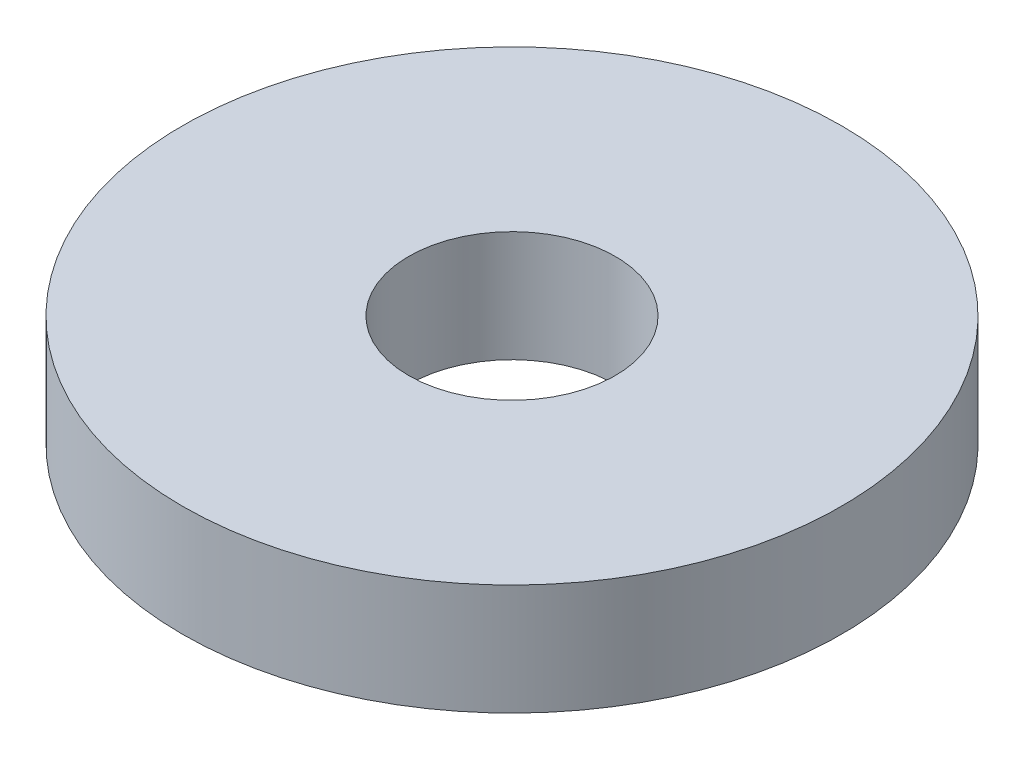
from build123d import *

# Parameters (mm, degrees)
SKETCH1_R      = 2.6416
SKETCH1_R_2    = 0.82804
EXTRUDE1_DEPTH = 0.889


with BuildPart() as part:
    # Sketch1 → Extrude1 (new body)
    with BuildSketch(Plane(origin=(0, 0, 0), x_dir=(1, 0, 0), z_dir=(0, 1, 0))):
        with Locations(Location((0, 0, 0), (0, 0, 270))):
            Circle(SKETCH1_R)
        with Locations(Location((0, 0, 0), (0, 0, 270))):
            Circle(SKETCH1_R_2, mode=Mode.SUBTRACT)
    extrude(amount=EXTRUDE1_DEPTH)


solid = part.part
